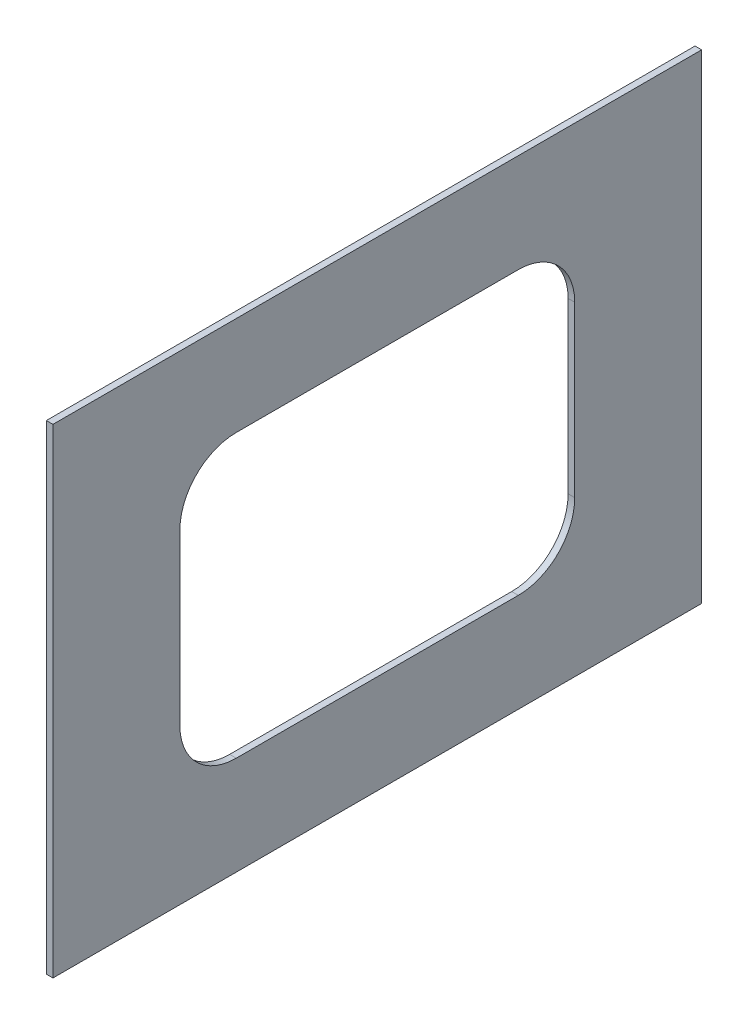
from build123d import *

# Parameters (mm, degrees)
SKETCH1_W           = 1168.4
SKETCH1_H           = 863.6
BOSS_EXTRUDE1_DEPTH = 11.90625


with BuildPart() as part:
    # Sketch1 → Boss-Extrude1 (new body)
    with BuildSketch(Plane(origin=(0, 0, 0), x_dir=(0, 0, -1), z_dir=(1, 0, 0))):
        with Locations((584.2, 431.8)):
            Rectangle(SKETCH1_W, SKETCH1_H)
        with BuildLine():
            Line((330.2, 685.8), (838.2, 685.8))
            ThreePointArc((838.2, 685.8), (910.042048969, 656.042048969), (939.8, 584.2))
            Line((939.8, 584.2), (939.8, 279.4))
            ThreePointArc((939.8, 279.4), (910.042048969, 207.557951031), (838.2, 177.8))
            Line((838.2, 177.8), (330.2, 177.8))
            ThreePointArc((330.2, 177.8), (258.357951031, 207.557951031), (228.6, 279.4))
            Line((228.6, 279.4), (228.6, 584.2))
            ThreePointArc((228.6, 584.2), (258.357951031, 656.042048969), (330.2, 685.8))
        make_face(mode=Mode.SUBTRACT)
    extrude(amount=BOSS_EXTRUDE1_DEPTH)


solid = part.part
